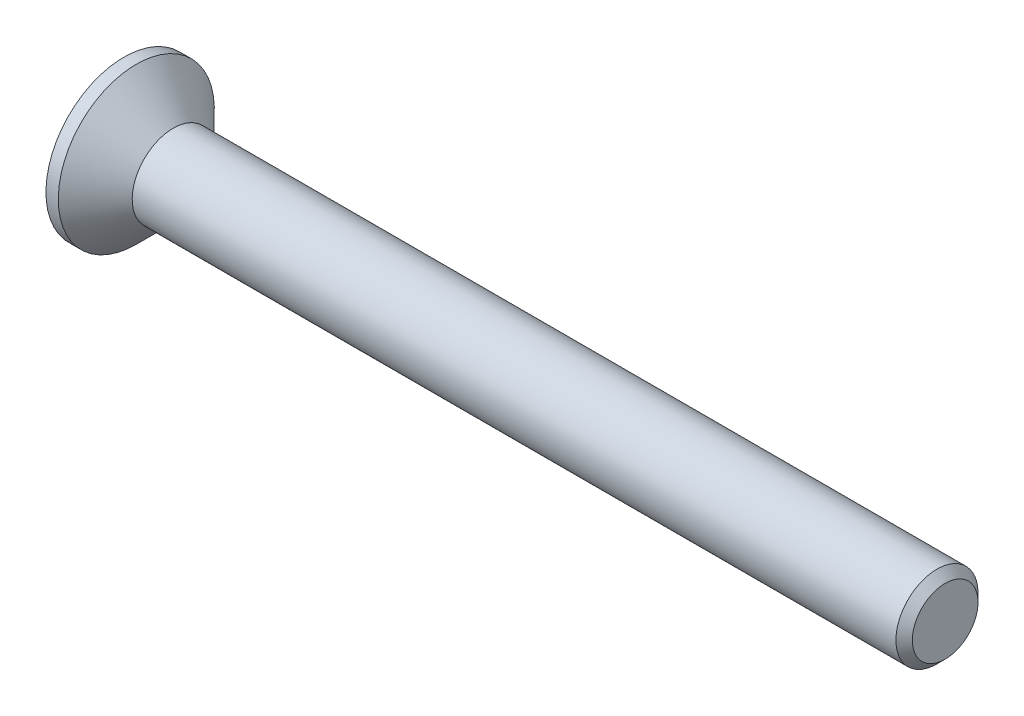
ISO-10303-21;
HEADER;
FILE_DESCRIPTION(('STEP AP214'),'2;1');
FILE_NAME('part.step','',(''),(''),'','','');
FILE_SCHEMA(('AUTOMOTIVE_DESIGN { 1 0 10303 214 1 1 1 1 }'));
ENDSEC;
DATA;
#1=APPLICATION_CONTEXT('core data for automotive mechanical design processes');
#2=APPLICATION_PROTOCOL_DEFINITION('international standard','automotive_design',2000,#1);
#3=PRODUCT_CONTEXT('',#1,'mechanical');
#4=PRODUCT('Part','Part','',(#3));
#5=PRODUCT_RELATED_PRODUCT_CATEGORY('part','',(#4));
#6=PRODUCT_DEFINITION_FORMATION('','',#4);
#7=PRODUCT_DEFINITION_CONTEXT('part definition',#1,'design');
#8=PRODUCT_DEFINITION('design','',#6,#7);
#9=PRODUCT_DEFINITION_SHAPE('','',#8);
#10=(LENGTH_UNIT() NAMED_UNIT(*) SI_UNIT(.MILLI.,.METRE.));
#11=(NAMED_UNIT(*) PLANE_ANGLE_UNIT() SI_UNIT($,.RADIAN.));
#12=(NAMED_UNIT(*) SI_UNIT($,.STERADIAN.) SOLID_ANGLE_UNIT());
#13=UNCERTAINTY_MEASURE_WITH_UNIT(LENGTH_MEASURE(1.E-05),#10,'distance_accuracy_value','');
#14=(GEOMETRIC_REPRESENTATION_CONTEXT(3) GLOBAL_UNCERTAINTY_ASSIGNED_CONTEXT((#13)) GLOBAL_UNIT_ASSIGNED_CONTEXT((#10,
#11,#12)) REPRESENTATION_CONTEXT('',''));
#15=CARTESIAN_POINT('',(0.,0.,0.));
#16=DIRECTION('',(0.,0.,1.));
#17=DIRECTION('',(1.,0.,0.));
#18=AXIS2_PLACEMENT_3D('',#15,#16,#17);
#19=CARTESIAN_POINT('',(0.,0.,0.));
#20=DIRECTION('',(-1.,0.,0.));
#21=DIRECTION('',(0.,-1.,0.));
#22=AXIS2_PLACEMENT_3D('',#19,#20,#21);
#23=CONICAL_SURFACE('',#22,1.,0.78539816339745);
#24=CARTESIAN_POINT('',(-0.899999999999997,0.,0.));
#25=DIRECTION('',(-1.,0.,0.));
#26=DIRECTION('',(0.,-1.,0.));
#27=AXIS2_PLACEMENT_3D('',#24,#25,#26);
#28=CIRCLE('',#27,1.9);
#29=CARTESIAN_POINT('',(-0.899999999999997,-1.9,0.));
#30=VERTEX_POINT('',#29);
#31=EDGE_CURVE('E189',#30,#30,#28,.T.);
#32=ORIENTED_EDGE('',*,*,#31,.F.);
#33=EDGE_LOOP('',(#32));
#34=FACE_BOUND('',#33,.T.);
#35=CARTESIAN_POINT('',(0.,0.,0.));
#36=DIRECTION('',(-1.,0.,0.));
#37=DIRECTION('',(0.,-1.,0.));
#38=AXIS2_PLACEMENT_3D('',#35,#36,#37);
#39=CIRCLE('',#38,1.);
#40=CARTESIAN_POINT('',(0.,-1.,0.));
#41=VERTEX_POINT('',#40);
#42=EDGE_CURVE('E212',#41,#41,#39,.T.);
#43=ORIENTED_EDGE('',*,*,#42,.T.);
#44=EDGE_LOOP('',(#43));
#45=FACE_BOUND('',#44,.T.);
#46=ADVANCED_FACE('F33',(#34,#45),#23,.T.);
#47=CARTESIAN_POINT('',(-1.2,0.,0.));
#48=DIRECTION('',(-1.,0.,0.));
#49=DIRECTION('',(0.,-1.,0.));
#50=AXIS2_PLACEMENT_3D('',#47,#48,#49);
#51=CYLINDRICAL_SURFACE('',#50,1.);
#52=CARTESIAN_POINT('',(18.6,0.,0.));
#53=DIRECTION('',(-1.,0.,0.));
#54=DIRECTION('',(0.,-1.,0.));
#55=AXIS2_PLACEMENT_3D('',#52,#53,#54);
#56=CIRCLE('',#55,1.);
#57=CARTESIAN_POINT('',(18.6,-1.,0.));
#58=VERTEX_POINT('',#57);
#59=EDGE_CURVE('E41',#58,#58,#56,.T.);
#60=ORIENTED_EDGE('',*,*,#59,.T.);
#61=EDGE_LOOP('',(#60));
#62=FACE_BOUND('',#61,.T.);
#63=ORIENTED_EDGE('',*,*,#42,.F.);
#64=EDGE_LOOP('',(#63));
#65=FACE_BOUND('',#64,.T.);
#66=ADVANCED_FACE('F217',(#62,#65),#51,.T.);
#67=CARTESIAN_POINT('',(18.8,0.,0.));
#68=DIRECTION('',(-1.,0.,0.));
#69=DIRECTION('',(0.,-1.,0.));
#70=AXIS2_PLACEMENT_3D('',#67,#68,#69);
#71=PLANE('',#70);
#72=CARTESIAN_POINT('',(18.8,0.,0.));
#73=DIRECTION('',(-1.,0.,0.));
#74=DIRECTION('',(0.,-1.,0.));
#75=AXIS2_PLACEMENT_3D('',#72,#73,#74);
#76=CIRCLE('',#75,0.799999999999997);
#77=CARTESIAN_POINT('',(18.8,-0.799999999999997,0.));
#78=VERTEX_POINT('',#77);
#79=EDGE_CURVE('E11',#78,#78,#76,.F.);
#80=ORIENTED_EDGE('',*,*,#79,.T.);
#81=EDGE_LOOP('',(#80));
#82=FACE_BOUND('',#81,.T.);
#83=ADVANCED_FACE('F239',(#82),#71,.F.);
#84=CARTESIAN_POINT('',(-1.2,1.9,0.));
#85=DIRECTION('',(1.,0.,0.));
#86=DIRECTION('',(0.,1.,0.));
#87=AXIS2_PLACEMENT_3D('',#84,#85,#86);
#88=PLANE('',#87);
#89=DIRECTION('',(0.,0.,-1.));
#90=VECTOR('',#89,1.);
#91=CARTESIAN_POINT('',(-1.2,0.3,-1.175));
#92=LINE('',#91,#90);
#93=CARTESIAN_POINT('',(-1.2,0.3,-0.3));
#94=VERTEX_POINT('',#93);
#95=CARTESIAN_POINT('',(-1.2,0.3,-1.175));
#96=VERTEX_POINT('',#95);
#97=EDGE_CURVE('E158',#94,#96,#92,.T.);
#98=ORIENTED_EDGE('',*,*,#97,.F.);
#99=DIRECTION('',(0.,-1.,0.));
#100=VECTOR('',#99,1.);
#101=CARTESIAN_POINT('',(-1.2,0.3,-0.3));
#102=LINE('',#101,#100);
#103=CARTESIAN_POINT('',(-1.2,1.175,-0.3));
#104=VERTEX_POINT('',#103);
#105=EDGE_CURVE('E48',#104,#94,#102,.T.);
#106=ORIENTED_EDGE('',*,*,#105,.F.);
#107=DIRECTION('',(0.,0.,-1.));
#108=VECTOR('',#107,1.);
#109=CARTESIAN_POINT('',(-1.2,1.175,-0.3));
#110=LINE('',#109,#108);
#111=CARTESIAN_POINT('',(-1.2,1.175,0.3));
#112=VERTEX_POINT('',#111);
#113=EDGE_CURVE('E185',#112,#104,#110,.T.);
#114=ORIENTED_EDGE('',*,*,#113,.F.);
#115=DIRECTION('',(0.,1.,0.));
#116=VECTOR('',#115,1.);
#117=CARTESIAN_POINT('',(-1.2,1.175,0.3));
#118=LINE('',#117,#116);
#119=CARTESIAN_POINT('',(-1.2,0.3,0.3));
#120=VERTEX_POINT('',#119);
#121=EDGE_CURVE('E183',#120,#112,#118,.T.);
#122=ORIENTED_EDGE('',*,*,#121,.F.);
#123=DIRECTION('',(0.,0.,-1.));
#124=VECTOR('',#123,1.);
#125=CARTESIAN_POINT('',(-1.2,0.3,0.3));
#126=LINE('',#125,#124);
#127=CARTESIAN_POINT('',(-1.2,0.3,1.175));
#128=VERTEX_POINT('',#127);
#129=EDGE_CURVE('E132',#128,#120,#126,.T.);
#130=ORIENTED_EDGE('',*,*,#129,.F.);
#131=DIRECTION('',(0.,1.,0.));
#132=VECTOR('',#131,1.);
#133=CARTESIAN_POINT('',(-1.2,0.3,1.175));
#134=LINE('',#133,#132);
#135=CARTESIAN_POINT('',(-1.2,-0.3,1.175));
#136=VERTEX_POINT('',#135);
#137=EDGE_CURVE('E179',#136,#128,#134,.T.);
#138=ORIENTED_EDGE('',*,*,#137,.F.);
#139=DIRECTION('',(0.,0.,1.));
#140=VECTOR('',#139,1.);
#141=CARTESIAN_POINT('',(-1.2,-0.3,1.175));
#142=LINE('',#141,#140);
#143=CARTESIAN_POINT('',(-1.2,-0.3,0.3));
#144=VERTEX_POINT('',#143);
#145=EDGE_CURVE('E176',#144,#136,#142,.T.);
#146=ORIENTED_EDGE('',*,*,#145,.F.);
#147=DIRECTION('',(0.,1.,0.));
#148=VECTOR('',#147,1.);
#149=CARTESIAN_POINT('',(-1.2,-0.3,0.3));
#150=LINE('',#149,#148);
#151=CARTESIAN_POINT('',(-1.2,-1.175,0.3));
#152=VERTEX_POINT('',#151);
#153=EDGE_CURVE('E173',#152,#144,#150,.T.);
#154=ORIENTED_EDGE('',*,*,#153,.F.);
#155=DIRECTION('',(0.,0.,1.));
#156=VECTOR('',#155,1.);
#157=CARTESIAN_POINT('',(-1.2,-1.175,0.3));
#158=LINE('',#157,#156);
#159=CARTESIAN_POINT('',(-1.2,-1.175,-0.3));
#160=VERTEX_POINT('',#159);
#161=EDGE_CURVE('E170',#160,#152,#158,.T.);
#162=ORIENTED_EDGE('',*,*,#161,.F.);
#163=DIRECTION('',(0.,-1.,0.));
#164=VECTOR('',#163,1.);
#165=CARTESIAN_POINT('',(-1.2,-1.175,-0.3));
#166=LINE('',#165,#164);
#167=CARTESIAN_POINT('',(-1.2,-0.3,-0.3));
#168=VERTEX_POINT('',#167);
#169=EDGE_CURVE('E167',#168,#160,#166,.T.);
#170=ORIENTED_EDGE('',*,*,#169,.F.);
#171=DIRECTION('',(0.,0.,1.));
#172=VECTOR('',#171,1.);
#173=CARTESIAN_POINT('',(-1.2,-0.3,-0.3));
#174=LINE('',#173,#172);
#175=CARTESIAN_POINT('',(-1.2,-0.3,-1.175));
#176=VERTEX_POINT('',#175);
#177=EDGE_CURVE('E164',#176,#168,#174,.T.);
#178=ORIENTED_EDGE('',*,*,#177,.F.);
#179=DIRECTION('',(0.,-1.,0.));
#180=VECTOR('',#179,1.);
#181=CARTESIAN_POINT('',(-1.2,-0.3,-1.175));
#182=LINE('',#181,#180);
#183=EDGE_CURVE('E161',#96,#176,#182,.T.);
#184=ORIENTED_EDGE('',*,*,#183,.F.);
#185=EDGE_LOOP('',(#98,#106,#114,#122,#130,#138,#146,#154,#162,#170,#178,#184));
#186=FACE_BOUND('',#185,.T.);
#187=CARTESIAN_POINT('',(-1.2,0.,0.));
#188=DIRECTION('',(-1.,0.,0.));
#189=DIRECTION('',(0.,-1.,0.));
#190=AXIS2_PLACEMENT_3D('',#187,#188,#189);
#191=CIRCLE('',#190,1.9);
#192=CARTESIAN_POINT('',(-1.2,-1.9,0.));
#193=VERTEX_POINT('',#192);
#194=EDGE_CURVE('E209',#193,#193,#191,.T.);
#195=ORIENTED_EDGE('',*,*,#194,.T.);
#196=EDGE_LOOP('',(#195));
#197=FACE_BOUND('',#196,.T.);
#198=ADVANCED_FACE('F230',(#186,#197),#88,.F.);
#199=CARTESIAN_POINT('',(-1.2,0.,0.));
#200=DIRECTION('',(-1.,0.,0.));
#201=DIRECTION('',(0.,-1.,0.));
#202=AXIS2_PLACEMENT_3D('',#199,#200,#201);
#203=CYLINDRICAL_SURFACE('',#202,1.9);
#204=ORIENTED_EDGE('',*,*,#194,.F.);
#205=EDGE_LOOP('',(#204));
#206=FACE_BOUND('',#205,.T.);
#207=ORIENTED_EDGE('',*,*,#31,.T.);
#208=EDGE_LOOP('',(#207));
#209=FACE_BOUND('',#208,.T.);
#210=ADVANCED_FACE('F222',(#206,#209),#203,.T.);
#211=CARTESIAN_POINT('',(18.6,0.,0.));
#212=DIRECTION('',(-1.,0.,0.));
#213=DIRECTION('',(0.,-1.,0.));
#214=AXIS2_PLACEMENT_3D('',#211,#212,#213);
#215=CONICAL_SURFACE('',#214,1.,0.785398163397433);
#216=ORIENTED_EDGE('',*,*,#79,.F.);
#217=EDGE_LOOP('',(#216));
#218=FACE_BOUND('',#217,.T.);
#219=ORIENTED_EDGE('',*,*,#59,.F.);
#220=EDGE_LOOP('',(#219));
#221=FACE_BOUND('',#220,.T.);
#222=ADVANCED_FACE('F35',(#218,#221),#215,.T.);
#223=CARTESIAN_POINT('',(-0.249999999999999,0.3,-0.3));
#224=DIRECTION('',(0.,0.,-1.));
#225=DIRECTION('',(0.,1.,0.));
#226=AXIS2_PLACEMENT_3D('',#223,#224,#225);
#227=PLANE('',#226);
#228=ORIENTED_EDGE('',*,*,#105,.T.);
#229=DIRECTION('',(-1.,0.,0.));
#230=VECTOR('',#229,1.);
#231=CARTESIAN_POINT('',(-0.249999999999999,0.3,-0.3));
#232=LINE('',#231,#230);
#233=CARTESIAN_POINT('',(-0.249999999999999,0.3,-0.3));
#234=VERTEX_POINT('',#233);
#235=EDGE_CURVE('E96',#234,#94,#232,.T.);
#236=ORIENTED_EDGE('',*,*,#235,.F.);
#237=DIRECTION('',(0.,-1.,0.));
#238=VECTOR('',#237,1.);
#239=CARTESIAN_POINT('',(-0.249999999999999,0.3,-0.3));
#240=LINE('',#239,#238);
#241=CARTESIAN_POINT('',(-0.249999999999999,1.175,-0.3));
#242=VERTEX_POINT('',#241);
#243=EDGE_CURVE('E187',#242,#234,#240,.T.);
#244=ORIENTED_EDGE('',*,*,#243,.F.);
#245=DIRECTION('',(-1.,0.,0.));
#246=VECTOR('',#245,1.);
#247=CARTESIAN_POINT('',(-0.249999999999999,1.175,-0.3));
#248=LINE('',#247,#246);
#249=EDGE_CURVE('E56',#242,#104,#248,.T.);
#250=ORIENTED_EDGE('',*,*,#249,.T.);
#251=EDGE_LOOP('',(#228,#236,#244,#250));
#252=FACE_BOUND('',#251,.T.);
#253=ADVANCED_FACE('F221',(#252),#227,.F.);
#254=CARTESIAN_POINT('',(-0.249999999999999,1.175,-0.3));
#255=DIRECTION('',(0.,1.,0.));
#256=DIRECTION('',(-1.,0.,0.));
#257=AXIS2_PLACEMENT_3D('',#254,#255,#256);
#258=PLANE('',#257);
#259=ORIENTED_EDGE('',*,*,#113,.T.);
#260=ORIENTED_EDGE('',*,*,#249,.F.);
#261=DIRECTION('',(0.,0.,-1.));
#262=VECTOR('',#261,1.);
#263=CARTESIAN_POINT('',(-0.249999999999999,1.175,-0.3));
#264=LINE('',#263,#262);
#265=CARTESIAN_POINT('',(-0.249999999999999,1.175,0.3));
#266=VERTEX_POINT('',#265);
#267=EDGE_CURVE('E144',#266,#242,#264,.T.);
#268=ORIENTED_EDGE('',*,*,#267,.F.);
#269=DIRECTION('',(-1.,0.,0.));
#270=VECTOR('',#269,1.);
#271=CARTESIAN_POINT('',(-0.249999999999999,1.175,0.3));
#272=LINE('',#271,#270);
#273=EDGE_CURVE('E136',#266,#112,#272,.T.);
#274=ORIENTED_EDGE('',*,*,#273,.T.);
#275=EDGE_LOOP('',(#259,#260,#268,#274));
#276=FACE_BOUND('',#275,.T.);
#277=ADVANCED_FACE('F228',(#276),#258,.F.);
#278=CARTESIAN_POINT('',(-0.249999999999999,1.175,0.3));
#279=DIRECTION('',(0.,0.,1.));
#280=DIRECTION('',(0.,-1.,0.));
#281=AXIS2_PLACEMENT_3D('',#278,#279,#280);
#282=PLANE('',#281);
#283=ORIENTED_EDGE('',*,*,#121,.T.);
#284=ORIENTED_EDGE('',*,*,#273,.F.);
#285=DIRECTION('',(0.,1.,0.));
#286=VECTOR('',#285,1.);
#287=CARTESIAN_POINT('',(-0.249999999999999,1.175,0.3));
#288=LINE('',#287,#286);
#289=CARTESIAN_POINT('',(-0.249999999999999,0.3,0.3));
#290=VERTEX_POINT('',#289);
#291=EDGE_CURVE('E140',#290,#266,#288,.T.);
#292=ORIENTED_EDGE('',*,*,#291,.F.);
#293=DIRECTION('',(-1.,0.,0.));
#294=VECTOR('',#293,1.);
#295=CARTESIAN_POINT('',(-0.249999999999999,0.3,0.3));
#296=LINE('',#295,#294);
#297=EDGE_CURVE('E125',#290,#120,#296,.T.);
#298=ORIENTED_EDGE('',*,*,#297,.T.);
#299=EDGE_LOOP('',(#283,#284,#292,#298));
#300=FACE_BOUND('',#299,.T.);
#301=ADVANCED_FACE('F141',(#300),#282,.F.);
#302=CARTESIAN_POINT('',(-0.249999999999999,0.3,0.3));
#303=DIRECTION('',(0.,1.,0.));
#304=DIRECTION('',(0.,0.,1.));
#305=AXIS2_PLACEMENT_3D('',#302,#303,#304);
#306=PLANE('',#305);
#307=ORIENTED_EDGE('',*,*,#129,.T.);
#308=ORIENTED_EDGE('',*,*,#297,.F.);
#309=DIRECTION('',(0.,0.,-1.));
#310=VECTOR('',#309,1.);
#311=CARTESIAN_POINT('',(-0.249999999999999,0.3,0.3));
#312=LINE('',#311,#310);
#313=CARTESIAN_POINT('',(-0.249999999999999,0.3,1.175));
#314=VERTEX_POINT('',#313);
#315=EDGE_CURVE('E129',#314,#290,#312,.T.);
#316=ORIENTED_EDGE('',*,*,#315,.F.);
#317=DIRECTION('',(-1.,0.,0.));
#318=VECTOR('',#317,1.);
#319=CARTESIAN_POINT('',(-0.249999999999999,0.3,1.175));
#320=LINE('',#319,#318);
#321=EDGE_CURVE('E137',#314,#128,#320,.T.);
#322=ORIENTED_EDGE('',*,*,#321,.T.);
#323=EDGE_LOOP('',(#307,#308,#316,#322));
#324=FACE_BOUND('',#323,.T.);
#325=ADVANCED_FACE('F127',(#324),#306,.F.);
#326=CARTESIAN_POINT('',(-0.249999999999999,0.3,1.175));
#327=DIRECTION('',(0.,0.,1.));
#328=DIRECTION('',(1.,0.,0.));
#329=AXIS2_PLACEMENT_3D('',#326,#327,#328);
#330=PLANE('',#329);
#331=ORIENTED_EDGE('',*,*,#137,.T.);
#332=ORIENTED_EDGE('',*,*,#321,.F.);
#333=DIRECTION('',(0.,1.,0.));
#334=VECTOR('',#333,1.);
#335=CARTESIAN_POINT('',(-0.249999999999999,0.3,1.175));
#336=LINE('',#335,#334);
#337=CARTESIAN_POINT('',(-0.249999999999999,-0.3,1.175));
#338=VERTEX_POINT('',#337);
#339=EDGE_CURVE('E150',#338,#314,#336,.T.);
#340=ORIENTED_EDGE('',*,*,#339,.F.);
#341=DIRECTION('',(-1.,0.,0.));
#342=VECTOR('',#341,1.);
#343=CARTESIAN_POINT('',(-0.249999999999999,-0.3,1.175));
#344=LINE('',#343,#342);
#345=EDGE_CURVE('E192',#338,#136,#344,.T.);
#346=ORIENTED_EDGE('',*,*,#345,.T.);
#347=EDGE_LOOP('',(#331,#332,#340,#346));
#348=FACE_BOUND('',#347,.T.);
#349=ADVANCED_FACE('F277',(#348),#330,.F.);
#350=CARTESIAN_POINT('',(-0.249999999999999,-0.3,1.175));
#351=DIRECTION('',(0.,-1.,0.));
#352=DIRECTION('',(0.,0.,-1.));
#353=AXIS2_PLACEMENT_3D('',#350,#351,#352);
#354=PLANE('',#353);
#355=ORIENTED_EDGE('',*,*,#145,.T.);
#356=ORIENTED_EDGE('',*,*,#345,.F.);
#357=DIRECTION('',(0.,0.,1.));
#358=VECTOR('',#357,1.);
#359=CARTESIAN_POINT('',(-0.249999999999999,-0.3,1.175));
#360=LINE('',#359,#358);
#361=CARTESIAN_POINT('',(-0.249999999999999,-0.3,0.3));
#362=VERTEX_POINT('',#361);
#363=EDGE_CURVE('E152',#362,#338,#360,.T.);
#364=ORIENTED_EDGE('',*,*,#363,.F.);
#365=DIRECTION('',(-1.,0.,0.));
#366=VECTOR('',#365,1.);
#367=CARTESIAN_POINT('',(-0.249999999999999,-0.3,0.3));
#368=LINE('',#367,#366);
#369=EDGE_CURVE('E194',#362,#144,#368,.T.);
#370=ORIENTED_EDGE('',*,*,#369,.T.);
#371=EDGE_LOOP('',(#355,#356,#364,#370));
#372=FACE_BOUND('',#371,.T.);
#373=ADVANCED_FACE('F273',(#372),#354,.F.);
#374=CARTESIAN_POINT('',(-0.249999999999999,-0.3,0.3));
#375=DIRECTION('',(0.,0.,1.));
#376=DIRECTION('',(1.,0.,0.));
#377=AXIS2_PLACEMENT_3D('',#374,#375,#376);
#378=PLANE('',#377);
#379=ORIENTED_EDGE('',*,*,#153,.T.);
#380=ORIENTED_EDGE('',*,*,#369,.F.);
#381=DIRECTION('',(0.,1.,0.));
#382=VECTOR('',#381,1.);
#383=CARTESIAN_POINT('',(-0.249999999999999,-0.3,0.3));
#384=LINE('',#383,#382);
#385=CARTESIAN_POINT('',(-0.249999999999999,-1.175,0.3));
#386=VERTEX_POINT('',#385);
#387=EDGE_CURVE('E422',#386,#362,#384,.T.);
#388=ORIENTED_EDGE('',*,*,#387,.F.);
#389=DIRECTION('',(-1.,0.,0.));
#390=VECTOR('',#389,1.);
#391=CARTESIAN_POINT('',(-0.249999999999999,-1.175,0.3));
#392=LINE('',#391,#390);
#393=EDGE_CURVE('E196',#386,#152,#392,.T.);
#394=ORIENTED_EDGE('',*,*,#393,.T.);
#395=EDGE_LOOP('',(#379,#380,#388,#394));
#396=FACE_BOUND('',#395,.T.);
#397=ADVANCED_FACE('F269',(#396),#378,.F.);
#398=CARTESIAN_POINT('',(-0.249999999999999,-1.175,0.3));
#399=DIRECTION('',(0.,-1.,0.));
#400=DIRECTION('',(1.,0.,0.));
#401=AXIS2_PLACEMENT_3D('',#398,#399,#400);
#402=PLANE('',#401);
#403=ORIENTED_EDGE('',*,*,#161,.T.);
#404=ORIENTED_EDGE('',*,*,#393,.F.);
#405=DIRECTION('',(0.,0.,1.));
#406=VECTOR('',#405,1.);
#407=CARTESIAN_POINT('',(-0.249999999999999,-1.175,0.3));
#408=LINE('',#407,#406);
#409=CARTESIAN_POINT('',(-0.249999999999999,-1.175,-0.3));
#410=VERTEX_POINT('',#409);
#411=EDGE_CURVE('E419',#410,#386,#408,.T.);
#412=ORIENTED_EDGE('',*,*,#411,.F.);
#413=DIRECTION('',(-1.,0.,0.));
#414=VECTOR('',#413,1.);
#415=CARTESIAN_POINT('',(-0.249999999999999,-1.175,-0.3));
#416=LINE('',#415,#414);
#417=EDGE_CURVE('E198',#410,#160,#416,.T.);
#418=ORIENTED_EDGE('',*,*,#417,.T.);
#419=EDGE_LOOP('',(#403,#404,#412,#418));
#420=FACE_BOUND('',#419,.T.);
#421=ADVANCED_FACE('F265',(#420),#402,.F.);
#422=CARTESIAN_POINT('',(-0.249999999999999,-1.175,-0.3));
#423=DIRECTION('',(0.,0.,-1.));
#424=DIRECTION('',(0.,1.,0.));
#425=AXIS2_PLACEMENT_3D('',#422,#423,#424);
#426=PLANE('',#425);
#427=ORIENTED_EDGE('',*,*,#169,.T.);
#428=ORIENTED_EDGE('',*,*,#417,.F.);
#429=DIRECTION('',(0.,-1.,0.));
#430=VECTOR('',#429,1.);
#431=CARTESIAN_POINT('',(-0.249999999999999,-1.175,-0.3));
#432=LINE('',#431,#430);
#433=CARTESIAN_POINT('',(-0.249999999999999,-0.3,-0.3));
#434=VERTEX_POINT('',#433);
#435=EDGE_CURVE('E416',#434,#410,#432,.T.);
#436=ORIENTED_EDGE('',*,*,#435,.F.);
#437=DIRECTION('',(-1.,0.,0.));
#438=VECTOR('',#437,1.);
#439=CARTESIAN_POINT('',(-0.249999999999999,-0.3,-0.3));
#440=LINE('',#439,#438);
#441=EDGE_CURVE('E200',#434,#168,#440,.T.);
#442=ORIENTED_EDGE('',*,*,#441,.T.);
#443=EDGE_LOOP('',(#427,#428,#436,#442));
#444=FACE_BOUND('',#443,.T.);
#445=ADVANCED_FACE('F261',(#444),#426,.F.);
#446=CARTESIAN_POINT('',(-0.249999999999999,-0.3,-0.3));
#447=DIRECTION('',(0.,-1.,0.));
#448=DIRECTION('',(0.,0.,-1.));
#449=AXIS2_PLACEMENT_3D('',#446,#447,#448);
#450=PLANE('',#449);
#451=ORIENTED_EDGE('',*,*,#177,.T.);
#452=ORIENTED_EDGE('',*,*,#441,.F.);
#453=DIRECTION('',(0.,0.,1.));
#454=VECTOR('',#453,1.);
#455=CARTESIAN_POINT('',(-0.249999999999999,-0.3,-0.3));
#456=LINE('',#455,#454);
#457=CARTESIAN_POINT('',(-0.249999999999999,-0.3,-1.175));
#458=VERTEX_POINT('',#457);
#459=EDGE_CURVE('E413',#458,#434,#456,.T.);
#460=ORIENTED_EDGE('',*,*,#459,.F.);
#461=DIRECTION('',(-1.,0.,0.));
#462=VECTOR('',#461,1.);
#463=CARTESIAN_POINT('',(-0.249999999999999,-0.3,-1.175));
#464=LINE('',#463,#462);
#465=EDGE_CURVE('E202',#458,#176,#464,.T.);
#466=ORIENTED_EDGE('',*,*,#465,.T.);
#467=EDGE_LOOP('',(#451,#452,#460,#466));
#468=FACE_BOUND('',#467,.T.);
#469=ADVANCED_FACE('F257',(#468),#450,.F.);
#470=CARTESIAN_POINT('',(-0.249999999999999,-0.3,-1.175));
#471=DIRECTION('',(0.,0.,-1.));
#472=DIRECTION('',(-1.,0.,0.));
#473=AXIS2_PLACEMENT_3D('',#470,#471,#472);
#474=PLANE('',#473);
#475=ORIENTED_EDGE('',*,*,#183,.T.);
#476=ORIENTED_EDGE('',*,*,#465,.F.);
#477=DIRECTION('',(0.,-1.,0.));
#478=VECTOR('',#477,1.);
#479=CARTESIAN_POINT('',(-0.249999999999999,-0.3,-1.175));
#480=LINE('',#479,#478);
#481=CARTESIAN_POINT('',(-0.249999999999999,0.3,-1.175));
#482=VERTEX_POINT('',#481);
#483=EDGE_CURVE('E408',#482,#458,#480,.T.);
#484=ORIENTED_EDGE('',*,*,#483,.F.);
#485=DIRECTION('',(-1.,0.,0.));
#486=VECTOR('',#485,1.);
#487=CARTESIAN_POINT('',(-0.249999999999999,0.3,-1.175));
#488=LINE('',#487,#486);
#489=EDGE_CURVE('E204',#482,#96,#488,.T.);
#490=ORIENTED_EDGE('',*,*,#489,.T.);
#491=EDGE_LOOP('',(#475,#476,#484,#490));
#492=FACE_BOUND('',#491,.T.);
#493=ADVANCED_FACE('F253',(#492),#474,.F.);
#494=CARTESIAN_POINT('',(-0.249999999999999,0.3,-1.175));
#495=DIRECTION('',(0.,1.,0.));
#496=DIRECTION('',(0.,0.,1.));
#497=AXIS2_PLACEMENT_3D('',#494,#495,#496);
#498=PLANE('',#497);
#499=ORIENTED_EDGE('',*,*,#97,.T.);
#500=ORIENTED_EDGE('',*,*,#489,.F.);
#501=DIRECTION('',(0.,0.,-1.));
#502=VECTOR('',#501,1.);
#503=CARTESIAN_POINT('',(-0.249999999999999,0.3,-1.175));
#504=LINE('',#503,#502);
#505=EDGE_CURVE('E406',#234,#482,#504,.T.);
#506=ORIENTED_EDGE('',*,*,#505,.F.);
#507=ORIENTED_EDGE('',*,*,#235,.T.);
#508=EDGE_LOOP('',(#499,#500,#506,#507));
#509=FACE_BOUND('',#508,.T.);
#510=ADVANCED_FACE('F250',(#509),#498,.F.);
#511=CARTESIAN_POINT('',(-0.249999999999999,0.,0.));
#512=DIRECTION('',(1.,0.,0.));
#513=DIRECTION('',(0.,0.,-1.));
#514=AXIS2_PLACEMENT_3D('',#511,#512,#513);
#515=PLANE('',#514);
#516=ORIENTED_EDGE('',*,*,#243,.T.);
#517=ORIENTED_EDGE('',*,*,#505,.T.);
#518=ORIENTED_EDGE('',*,*,#483,.T.);
#519=ORIENTED_EDGE('',*,*,#459,.T.);
#520=ORIENTED_EDGE('',*,*,#435,.T.);
#521=ORIENTED_EDGE('',*,*,#411,.T.);
#522=ORIENTED_EDGE('',*,*,#387,.T.);
#523=ORIENTED_EDGE('',*,*,#363,.T.);
#524=ORIENTED_EDGE('',*,*,#339,.T.);
#525=ORIENTED_EDGE('',*,*,#315,.T.);
#526=ORIENTED_EDGE('',*,*,#291,.T.);
#527=ORIENTED_EDGE('',*,*,#267,.T.);
#528=EDGE_LOOP('',(#516,#517,#518,#519,#520,#521,#522,#523,#524,#525,#526,#527));
#529=FACE_BOUND('',#528,.T.);
#530=ADVANCED_FACE('F147',(#529),#515,.F.);
#531=CLOSED_SHELL('',(#46,#66,#83,#198,#210,#222,#253,#277,#301,#325,#349,#373,#397,#421,#445,
#469,#493,#510,#530));
#532=MANIFOLD_SOLID_BREP('B2',#531);
#533=ADVANCED_BREP_SHAPE_REPRESENTATION('',(#18,#532),#14);
#534=SHAPE_DEFINITION_REPRESENTATION(#9,#533);
ENDSEC;
END-ISO-10303-21;
